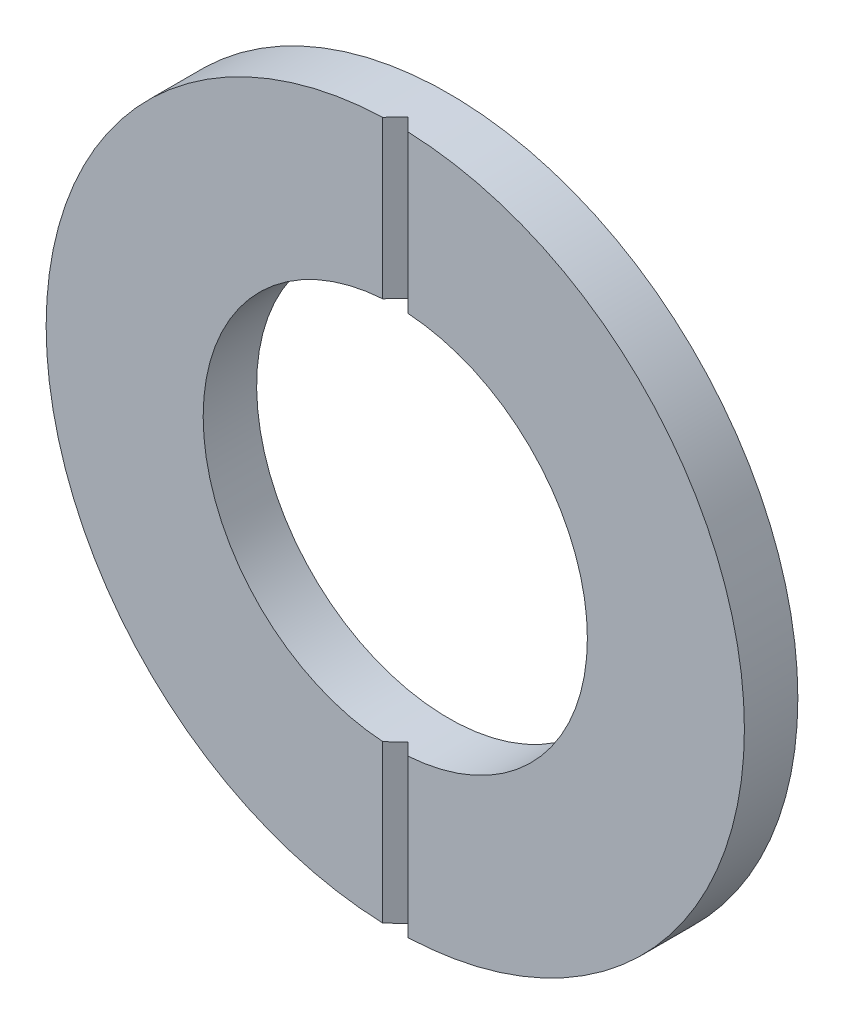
from build123d import *

# Parameters (mm, degrees)
SKETCH1_R           = 2.6543
SKETCH1_R_2         = 1.4605
OD_MMC_ID_NOM_DEPTH = 0.4064
EXTRUDE1_DEPTH      = 4.775682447
EXTRUDE1_DEPTH_BACK = 4.775682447


with BuildPart() as part:
    # Sketch1 → OD_MMC - ID_NOM (new body)
    with BuildSketch(Plane.XY):
        Circle(SKETCH1_R)
        Circle(SKETCH1_R_2, mode=Mode.SUBTRACT)
    extrude(amount=OD_MMC_ID_NOM_DEPTH)

    # Sketch2 → Extrude1 (cut, two sides: drawn at the far end of the back side and taken through both)
    with BuildSketch(Plane(origin=(0, 0, 0), x_dir=(1, 0, 0), z_dir=(0, 1, 0)).offset(-EXTRUDE1_DEPTH_BACK)):
        Polygon((-0.09525, -0.4064), (0.09525, -0.4064), (0, -0.31115), align=None)
    extrude(amount=EXTRUDE1_DEPTH + EXTRUDE1_DEPTH_BACK, mode=Mode.SUBTRACT)


solid = part.part
